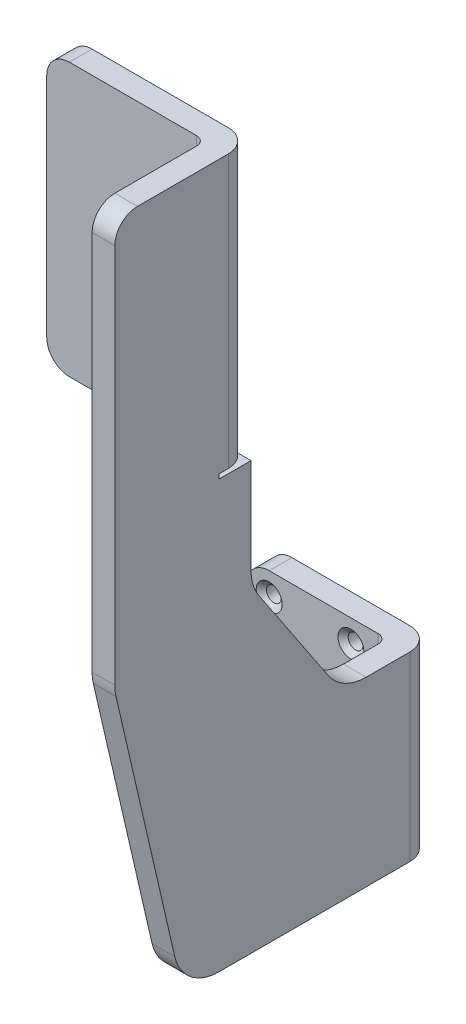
from build123d import *

# Parameters (mm, degrees)
SKETCH1_W                                         = 36
SKETCH1_H                                         = 40
BOSS_EXTRUDE1_DEPTH                               = 5
BOSS_EXTRUDE2_DEPTH                               = 5
FILLET1_R                                         = 5
FILLET2_R                                         = 2
FILLET3_R                                         = 10
SKETCH4_W                                         = 5
SKETCH4_H                                         = 60
BOSS_EXTRUDE3_DEPTH                               = 35
FILLET4_R                                         = 2
FILLET5_R                                         = 5
SKETCH5_W                                         = 7
SKETCH5_H                                         = 1
CUT_EXTRUDE1_DEPTH                                = 10
FILLET6_R                                         = 5
BOSS_EXTRUDE4_START                               = -20
BOSS_EXTRUDE4_DEPTH                               = 2.5
FILLET7_R                                         = 1
CSK_FOR_4_FLAT_HEAD_MACHINE_SCREW_100_D           = 3.2639
CSK_FOR_4_FLAT_HEAD_MACHINE_SCREW_100_DEPTH       = 20
CSK_FOR_4_FLAT_HEAD_MACHINE_SCREW_100_CSINK_D     = 5.715
CSK_FOR_4_FLAT_HEAD_MACHINE_SCREW_100_CSINK_ANGLE = 100
CSK_FOR_4_FLAT_HEAD_MACHINE_SCREW_100_TIP         = 0.980574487


with BuildPart() as part:
    # Sketch1 → Boss-Extrude1 (new body)
    with BuildSketch(Plane.XY):
        with Locations((18, 20)):
            Rectangle(SKETCH1_W, SKETCH1_H)
    extrude(amount=BOSS_EXTRUDE1_DEPTH)

    # Sketch3 → Boss-Extrude2 (add)
    with BuildSketch(Plane(origin=(36, 0, 0), x_dir=(0, 0, -1), z_dir=(1, 0, 0))):
        Polygon((-5, 40), (-20, 40), (-40, 70), (-40, 155), (-70, 155), (-70, 65), (-55, 0), (-5, 0), align=None)
    extrude(amount=-BOSS_EXTRUDE2_DEPTH)

    # Fillet1
    fillet1_edges = [part.edges().sort_by_distance(p)[0] for p in [
        (36, 20, 0),
        (33.5, 155, 70),
        (0, 0, 2.5),
        (0, 40, 2.5),
    ]]
    fillet(fillet1_edges, radius=FILLET1_R)

    # Fillet2
    fillet2_edges = [part.edges().sort_by_distance(p)[0] for p in [
        (31, 20, 5),
    ]]
    fillet(fillet2_edges, radius=FILLET2_R)

    # Fillet3
    fillet3_edges = [part.edges().sort_by_distance(p)[0] for p in [
        (33.5, 65, 70),
        (33.5, 0, 55),
        (33.5, 70, 40),
        (33.5, 40, 20),
    ]]
    fillet(fillet3_edges, radius=FILLET3_R)

    # Sketch4 → Boss-Extrude3 (add)
    with BuildSketch(Plane.ZY.offset(-31)):
        with Locations((42.5, 125)):
            Rectangle(SKETCH4_W, SKETCH4_H)
    extrude(amount=BOSS_EXTRUDE3_DEPTH)

    # Fillet4
    fillet4_edges = [part.edges().sort_by_distance(p)[0] for p in [
        (31, 125, 45),
    ]]
    fillet(fillet4_edges, radius=FILLET4_R)

    # Fillet5
    fillet5_edges = [part.edges().sort_by_distance(p)[0] for p in [
        (-4, 95, 42.5),
        (-4, 155, 42.5),
    ]]
    fillet(fillet5_edges, radius=FILLET5_R)

    # Sketch5 → Cut-Extrude1 (cut)
    with BuildSketch(Plane.ZY.offset(-31)):
        with Locations((43.5, 94.5)):
            Rectangle(SKETCH5_W, SKETCH5_H)
    extrude(amount=-CUT_EXTRUDE1_DEPTH, mode=Mode.SUBTRACT)

    # Fillet6
    fillet6_edges = [part.edges().sort_by_distance(p)[0] for p in [
        (36, 125, 40),
    ]]
    fillet(fillet6_edges, radius=FILLET6_R)

    # Sketch6 → Boss-Extrude4 (add, symmetric)
    with BuildSketch(Plane.XZ.offset(BOSS_EXTRUDE4_START)):
        with BuildLine():
            Line((31, 19), (17, 5))
            Line((17, 5), (29, 5))
            ThreePointArc((29, 5), (30.414213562, 5.585786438), (31, 7))
            Line((31, 7), (31, 19))
        make_face()
    extrude(amount=BOSS_EXTRUDE4_DEPTH, both=True)

    # Fillet7
    fillet7_edges = [part.edges().sort_by_distance(p)[0] for p in [
        (31, 22.5, 13),
        (31, 20, 19),
        (23, 22.5, 5),
        (17, 20, 5),
        (30.414213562, 22.5, 5.585786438),
        (31, 17.5, 13),
        (23, 17.5, 5),
        (30.414213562, 17.5, 5.585786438),
    ]]
    fillet(fillet7_edges, radius=FILLET7_R)

    # CSK for _4 Flat Head Machine Screw _100
    with Locations(Plane.XY.offset(5)):
        with Locations((5, 35), (23, 35), (5, 5), (23, 5)):
            CounterSinkHole(CSK_FOR_4_FLAT_HEAD_MACHINE_SCREW_100_D / 2, CSK_FOR_4_FLAT_HEAD_MACHINE_SCREW_100_CSINK_D / 2, depth=CSK_FOR_4_FLAT_HEAD_MACHINE_SCREW_100_DEPTH, counter_sink_angle=CSK_FOR_4_FLAT_HEAD_MACHINE_SCREW_100_CSINK_ANGLE)
            with Locations((0, 0, -(CSK_FOR_4_FLAT_HEAD_MACHINE_SCREW_100_DEPTH + CSK_FOR_4_FLAT_HEAD_MACHINE_SCREW_100_TIP / 2))):  # 118° drill point
                Cone(0, CSK_FOR_4_FLAT_HEAD_MACHINE_SCREW_100_D / 2, CSK_FOR_4_FLAT_HEAD_MACHINE_SCREW_100_TIP, mode=Mode.SUBTRACT)


solid = part.part
